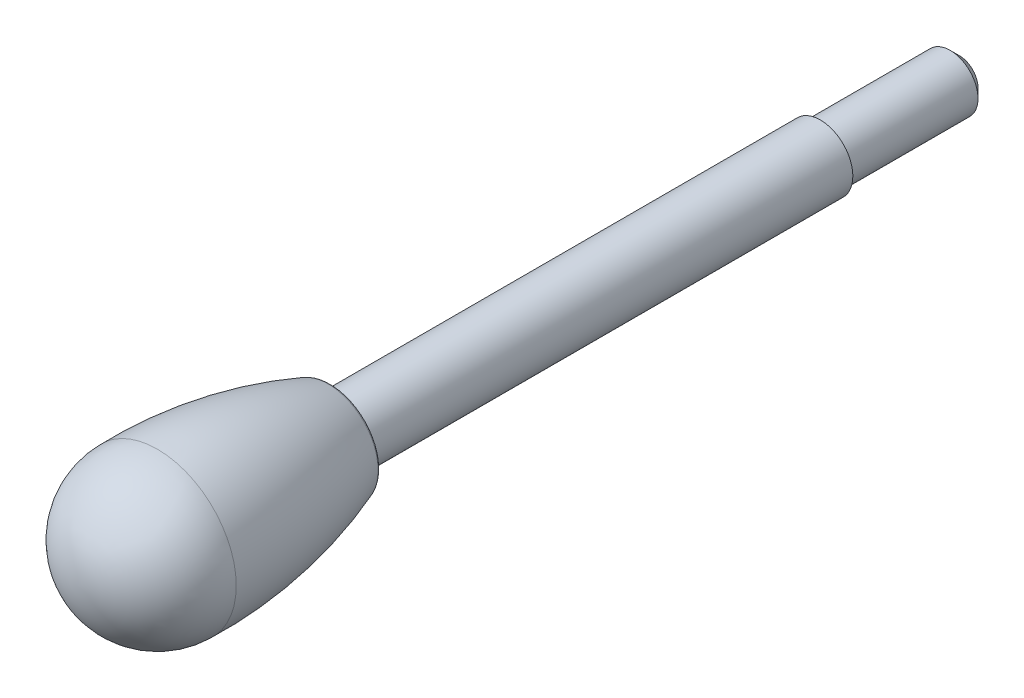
ISO-10303-21;
HEADER;
FILE_DESCRIPTION(('STEP AP214'),'2;1');
FILE_NAME('part.step','',(''),(''),'','','');
FILE_SCHEMA(('AUTOMOTIVE_DESIGN { 1 0 10303 214 1 1 1 1 }'));
ENDSEC;
DATA;
#1=APPLICATION_CONTEXT('core data for automotive mechanical design processes');
#2=APPLICATION_PROTOCOL_DEFINITION('international standard','automotive_design',2000,#1);
#3=PRODUCT_CONTEXT('',#1,'mechanical');
#4=PRODUCT('Part','Part','',(#3));
#5=PRODUCT_RELATED_PRODUCT_CATEGORY('part','',(#4));
#6=PRODUCT_DEFINITION_FORMATION('','',#4);
#7=PRODUCT_DEFINITION_CONTEXT('part definition',#1,'design');
#8=PRODUCT_DEFINITION('design','',#6,#7);
#9=PRODUCT_DEFINITION_SHAPE('','',#8);
#10=(LENGTH_UNIT() NAMED_UNIT(*) SI_UNIT(.MILLI.,.METRE.));
#11=(NAMED_UNIT(*) PLANE_ANGLE_UNIT() SI_UNIT($,.RADIAN.));
#12=(NAMED_UNIT(*) SI_UNIT($,.STERADIAN.) SOLID_ANGLE_UNIT());
#13=UNCERTAINTY_MEASURE_WITH_UNIT(LENGTH_MEASURE(1.E-05),#10,'distance_accuracy_value','');
#14=(GEOMETRIC_REPRESENTATION_CONTEXT(3) GLOBAL_UNCERTAINTY_ASSIGNED_CONTEXT((#13)) GLOBAL_UNIT_ASSIGNED_CONTEXT((#10,
#11,#12)) REPRESENTATION_CONTEXT('',''));
#15=CARTESIAN_POINT('',(0.,0.,0.));
#16=DIRECTION('',(0.,0.,1.));
#17=DIRECTION('',(1.,0.,0.));
#18=AXIS2_PLACEMENT_3D('',#15,#16,#17);
#19=CARTESIAN_POINT('',(0.,6.,0.));
#20=DIRECTION('',(0.,0.,1.));
#21=DIRECTION('',(0.,1.,0.));
#22=AXIS2_PLACEMENT_3D('',#19,#20,#21);
#23=PLANE('',#22);
#24=CARTESIAN_POINT('',(0.,0.,0.));
#25=DIRECTION('',(0.,0.,-1.));
#26=DIRECTION('',(0.,-1.,0.));
#27=AXIS2_PLACEMENT_3D('',#24,#25,#26);
#28=CIRCLE('',#27,6.);
#29=CARTESIAN_POINT('',(0.,-6.,0.));
#30=VERTEX_POINT('',#29);
#31=EDGE_CURVE('E8',#30,#30,#28,.T.);
#32=ORIENTED_EDGE('',*,*,#31,.F.);
#33=EDGE_LOOP('',(#32));
#34=FACE_BOUND('',#33,.T.);
#35=CARTESIAN_POINT('',(0.,0.,0.));
#36=DIRECTION('',(0.,0.,-1.));
#37=DIRECTION('',(0.,-1.,0.));
#38=AXIS2_PLACEMENT_3D('',#35,#36,#37);
#39=CIRCLE('',#38,7.);
#40=CARTESIAN_POINT('',(0.,-7.,0.));
#41=VERTEX_POINT('',#40);
#42=EDGE_CURVE('E40',#41,#41,#39,.T.);
#43=ORIENTED_EDGE('',*,*,#42,.T.);
#44=EDGE_LOOP('',(#43));
#45=FACE_BOUND('',#44,.T.);
#46=ADVANCED_FACE('F12',(#34,#45),#23,.F.);
#47=CARTESIAN_POINT('',(0.,0.,-35.));
#48=DIRECTION('',(0.,0.,-1.));
#49=DIRECTION('',(0.,-1.,0.));
#50=AXIS2_PLACEMENT_3D('',#47,#48,#49);
#51=CYLINDRICAL_SURFACE('',#50,6.);
#52=CARTESIAN_POINT('',(0.,0.,-28.));
#53=DIRECTION('',(0.,0.,-1.));
#54=DIRECTION('',(0.,-1.,0.));
#55=AXIS2_PLACEMENT_3D('',#52,#53,#54);
#56=CIRCLE('',#55,6.);
#57=CARTESIAN_POINT('',(0.,-6.,-28.));
#58=VERTEX_POINT('',#57);
#59=EDGE_CURVE('E18',#58,#58,#56,.T.);
#60=ORIENTED_EDGE('',*,*,#59,.F.);
#61=EDGE_LOOP('',(#60));
#62=FACE_BOUND('',#61,.T.);
#63=ORIENTED_EDGE('',*,*,#31,.T.);
#64=EDGE_LOOP('',(#63));
#65=FACE_BOUND('',#64,.T.);
#66=ADVANCED_FACE('F82',(#62,#65),#51,.T.);
#67=CARTESIAN_POINT('',(0.,0.,-28.));
#68=DIRECTION('',(0.,0.,1.));
#69=DIRECTION('',(0.,1.,0.));
#70=AXIS2_PLACEMENT_3D('',#67,#68,#69);
#71=CONICAL_SURFACE('',#70,6.,0.785398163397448);
#72=CARTESIAN_POINT('',(0.,0.,-30.));
#73=DIRECTION('',(0.,0.,-1.));
#74=DIRECTION('',(0.,-1.,0.));
#75=AXIS2_PLACEMENT_3D('',#72,#73,#74);
#76=CIRCLE('',#75,4.00000000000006);
#77=CARTESIAN_POINT('',(0.,-4.00000000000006,-30.));
#78=VERTEX_POINT('',#77);
#79=EDGE_CURVE('E22',#78,#78,#76,.T.);
#80=ORIENTED_EDGE('',*,*,#79,.F.);
#81=EDGE_LOOP('',(#80));
#82=FACE_BOUND('',#81,.T.);
#83=ORIENTED_EDGE('',*,*,#59,.T.);
#84=EDGE_LOOP('',(#83));
#85=FACE_BOUND('',#84,.T.);
#86=ADVANCED_FACE('F78',(#82,#85),#71,.T.);
#87=CARTESIAN_POINT('',(0.,0.,-30.));
#88=DIRECTION('',(0.,0.,1.));
#89=DIRECTION('',(0.,1.,0.));
#90=AXIS2_PLACEMENT_3D('',#87,#88,#89);
#91=PLANE('',#90);
#92=ORIENTED_EDGE('',*,*,#79,.T.);
#93=EDGE_LOOP('',(#92));
#94=FACE_BOUND('',#93,.T.);
#95=ADVANCED_FACE('F71',(#94),#91,.F.);
#96=CARTESIAN_POINT('',(0.,0.,143.));
#97=DIRECTION('',(0.,0.,-1.));
#98=DIRECTION('',(0.,1.,0.));
#99=AXIS2_PLACEMENT_3D('',#96,#97,#98);
#100=SPHERICAL_SURFACE('',#99,17.);
#101=CARTESIAN_POINT('',(0.,0.,142.999999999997));
#102=DIRECTION('',(0.,0.,-1.));
#103=DIRECTION('',(0.,-1.,0.));
#104=AXIS2_PLACEMENT_3D('',#101,#102,#103);
#105=CIRCLE('',#104,17.);
#106=CARTESIAN_POINT('',(0.,-17.,142.999999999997));
#107=VERTEX_POINT('',#106);
#108=EDGE_CURVE('E26',#107,#107,#105,.T.);
#109=ORIENTED_EDGE('',*,*,#108,.F.);
#110=EDGE_LOOP('',(#109));
#111=FACE_BOUND('',#110,.T.);
#112=ADVANCED_FACE('F66',(#111),#100,.T.);
#113=CARTESIAN_POINT('',(0.,0.,141.103564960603));
#114=DIRECTION('',(0.,0.,-1.));
#115=DIRECTION('',(0.,-1.,0.));
#116=AXIS2_PLACEMENT_3D('',#113,#114,#115);
#117=DEGENERATE_TOROIDAL_SURFACE('',#116,83.4821055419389,100.5,.F.);
#118=CARTESIAN_POINT('',(0.,0.,106.152225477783));
#119=DIRECTION('',(0.,0.,-1.));
#120=DIRECTION('',(0.,-1.,0.));
#121=AXIS2_PLACEMENT_3D('',#118,#119,#120);
#122=CIRCLE('',#121,10.7445035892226);
#123=CARTESIAN_POINT('',(0.,-10.7445035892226,106.152225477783));
#124=VERTEX_POINT('',#123);
#125=EDGE_CURVE('E31',#124,#124,#122,.T.);
#126=ORIENTED_EDGE('',*,*,#125,.F.);
#127=EDGE_LOOP('',(#126));
#128=FACE_BOUND('',#127,.T.);
#129=ORIENTED_EDGE('',*,*,#108,.T.);
#130=EDGE_LOOP('',(#129));
#131=FACE_BOUND('',#130,.T.);
#132=ADVANCED_FACE('F60',(#128,#131),#117,.F.);
#133=CARTESIAN_POINT('',(0.,0.,106.5));
#134=DIRECTION('',(0.,0.,-1.));
#135=DIRECTION('',(0.,-1.,0.));
#136=AXIS2_PLACEMENT_3D('',#133,#134,#135);
#137=TOROIDAL_SURFACE('',#136,9.80692538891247,1.);
#138=CARTESIAN_POINT('',(0.,0.,105.5));
#139=DIRECTION('',(0.,0.,-1.));
#140=DIRECTION('',(0.,-1.,0.));
#141=AXIS2_PLACEMENT_3D('',#138,#139,#140);
#142=CIRCLE('',#141,9.80692538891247);
#143=CARTESIAN_POINT('',(0.,-9.80692538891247,105.5));
#144=VERTEX_POINT('',#143);
#145=EDGE_CURVE('E34',#144,#144,#142,.T.);
#146=ORIENTED_EDGE('',*,*,#145,.F.);
#147=EDGE_LOOP('',(#146));
#148=FACE_BOUND('',#147,.T.);
#149=ORIENTED_EDGE('',*,*,#125,.T.);
#150=EDGE_LOOP('',(#149));
#151=FACE_BOUND('',#150,.T.);
#152=ADVANCED_FACE('F54',(#148,#151),#137,.T.);
#153=CARTESIAN_POINT('',(0.,7.,105.5));
#154=DIRECTION('',(0.,0.,1.));
#155=DIRECTION('',(0.,1.,0.));
#156=AXIS2_PLACEMENT_3D('',#153,#154,#155);
#157=PLANE('',#156);
#158=CARTESIAN_POINT('',(0.,0.,105.5));
#159=DIRECTION('',(0.,0.,-1.));
#160=DIRECTION('',(0.,-1.,0.));
#161=AXIS2_PLACEMENT_3D('',#158,#159,#160);
#162=CIRCLE('',#161,7.);
#163=CARTESIAN_POINT('',(0.,-7.,105.5));
#164=VERTEX_POINT('',#163);
#165=EDGE_CURVE('E37',#164,#164,#162,.T.);
#166=ORIENTED_EDGE('',*,*,#165,.F.);
#167=EDGE_LOOP('',(#166));
#168=FACE_BOUND('',#167,.T.);
#169=ORIENTED_EDGE('',*,*,#145,.T.);
#170=EDGE_LOOP('',(#169));
#171=FACE_BOUND('',#170,.T.);
#172=ADVANCED_FACE('F48',(#168,#171),#157,.F.);
#173=CARTESIAN_POINT('',(0.,0.,-35.));
#174=DIRECTION('',(0.,0.,-1.));
#175=DIRECTION('',(0.,-1.,0.));
#176=AXIS2_PLACEMENT_3D('',#173,#174,#175);
#177=CYLINDRICAL_SURFACE('',#176,7.);
#178=ORIENTED_EDGE('',*,*,#42,.F.);
#179=EDGE_LOOP('',(#178));
#180=FACE_BOUND('',#179,.T.);
#181=ORIENTED_EDGE('',*,*,#165,.T.);
#182=EDGE_LOOP('',(#181));
#183=FACE_BOUND('',#182,.T.);
#184=ADVANCED_FACE('F45',(#180,#183),#177,.T.);
#185=CLOSED_SHELL('',(#46,#66,#86,#95,#112,#132,#152,#172,#184));
#186=MANIFOLD_SOLID_BREP('B1',#185);
#187=ADVANCED_BREP_SHAPE_REPRESENTATION('',(#18,#186),#14);
#188=SHAPE_DEFINITION_REPRESENTATION(#9,#187);
ENDSEC;
END-ISO-10303-21;
